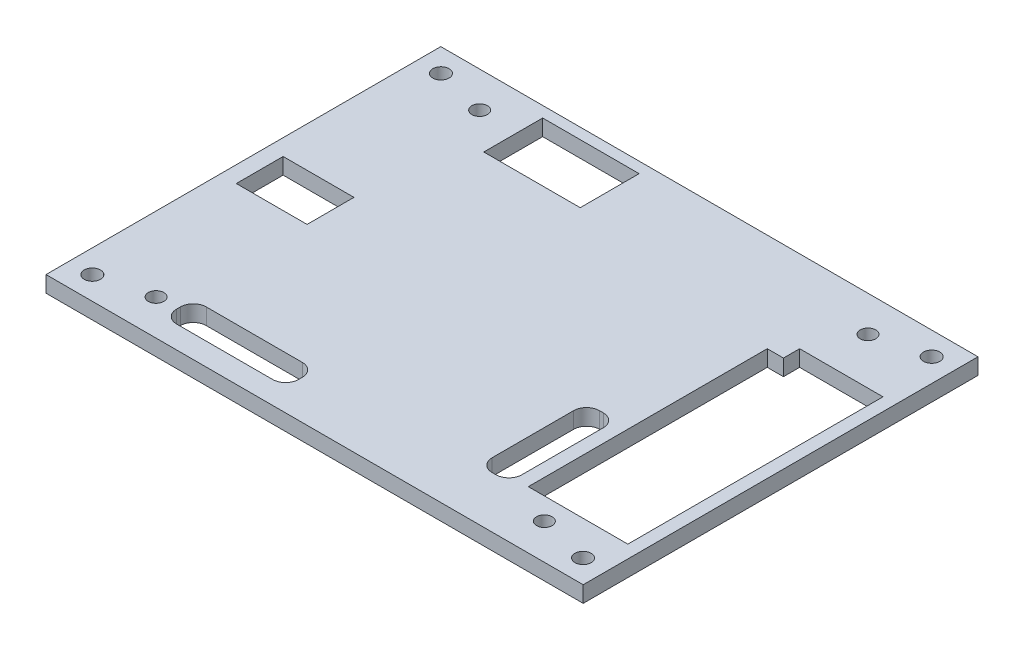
from build123d import *

# Parameters (mm, degrees)
SKETCH1_W          = 105.41
SKETCH1_H          = 77.47
EXTRUDE1_DEPTH     = 3.175
CUT_EXTRUDE1_REACH = 132.855
SKETCH2_R          = 1.524
CUT_EXTRUDE4_REACH = 132.855
SKETCH5_W          = 13.8938
SKETCH5_H          = 9.1948
SKETCH5_W_2        = 23.9268
SKETCH5_H_2        = 5.8166
SKETCH5_W_3        = 5.8166
SKETCH5_H_3        = 21.0566
CUT_EXTRUDE5_REACH = 132.855
SKETCH6_R          = 1.6
FILLET1_R          = 2.54


with BuildPart() as part:
    # Sketch1 → Extrude1 (new body)
    with BuildSketch(Plane(origin=(0, 0, 0), x_dir=(1, 0, 0), z_dir=(0, 1, 0))):
        with Locations((52.705, 38.735)):
            Rectangle(SKETCH1_W, SKETCH1_H)
    extrude(amount=EXTRUDE1_DEPTH)

    # Sketch2 → Cut-Extrude1 (cut, up to next)
    with BuildSketch(Plane(origin=(0, 3.175, 0), x_dir=(1, 0, 0), z_dir=(0, 1, 0)), mode=Mode.PRIVATE) as cut_extrude1_sk1:
        with Locations(Location((14.605, 70.485, 0), (0, 0, 270))):
            Circle(SKETCH2_R)
    cut_extrude1_tool1 = extrude(cut_extrude1_sk1.sketch, amount=-CUT_EXTRUDE1_REACH, mode=Mode.PRIVATE) & part.part
    # Sketch2 → Cut-Extrude1 (cut, up to next)
    with BuildSketch(Plane(origin=(0, 3.175, 0), x_dir=(1, 0, 0), z_dir=(0, 1, 0)), mode=Mode.PRIVATE) as cut_extrude1_sk2:
        with Locations(Location((90.805, 70.485, 0), (0, 0, 270))):
            Circle(SKETCH2_R)
    cut_extrude1_tool2 = extrude(cut_extrude1_sk2.sketch, amount=-CUT_EXTRUDE1_REACH, mode=Mode.PRIVATE) & part.part
    # Sketch2 → Cut-Extrude1 (cut, up to next)
    with BuildSketch(Plane(origin=(0, 3.175, 0), x_dir=(1, 0, 0), z_dir=(0, 1, 0)), mode=Mode.PRIVATE) as cut_extrude1_sk3:
        with Locations(Location((14.605, 6.985, 0), (0, 0, 270))):
            Circle(SKETCH2_R)
    cut_extrude1_tool3 = extrude(cut_extrude1_sk3.sketch, amount=-CUT_EXTRUDE1_REACH, mode=Mode.PRIVATE) & part.part
    # Sketch2 → Cut-Extrude1 (cut, up to next)
    with BuildSketch(Plane(origin=(0, 3.175, 0), x_dir=(1, 0, 0), z_dir=(0, 1, 0)), mode=Mode.PRIVATE) as cut_extrude1_sk4:
        with Locations(Location((90.805, 6.985, 0), (0, 0, 270))):
            Circle(SKETCH2_R)
    cut_extrude1_tool4 = extrude(cut_extrude1_sk4.sketch, amount=-CUT_EXTRUDE1_REACH, mode=Mode.PRIVATE) & part.part
    add(cut_extrude1_tool1.solids().sort_by_distance((14.605, 3.175, -70.485))[0], mode=Mode.SUBTRACT)
    add(cut_extrude1_tool2.solids().sort_by_distance((90.805, 3.175, -70.485))[0], mode=Mode.SUBTRACT)
    add(cut_extrude1_tool3.solids().sort_by_distance((14.605, 3.175, -6.985))[0], mode=Mode.SUBTRACT)
    add(cut_extrude1_tool4.solids().sort_by_distance((90.805, 3.175, -6.985))[0], mode=Mode.SUBTRACT)

    # Sketch5 → Cut-Extrude4 (cut, up to next)
    with BuildSketch(Plane(origin=(0, 3.175, 0), x_dir=(1, 0, 0), z_dir=(0, 1, 0)), mode=Mode.PRIVATE) as cut_extrude4_sk1:
        Polygon((33.5026, 75.3364), (41.0464, 75.3364), (41.0464, 63.7794), (22.1234, 63.7794), (22.1234, 75.3364), (29.6672, 75.3364), align=None)
    cut_extrude4_tool1 = extrude(cut_extrude4_sk1.sketch, amount=-CUT_EXTRUDE4_REACH, mode=Mode.PRIVATE) & part.part
    # Sketch5 → Cut-Extrude4 (cut, up to next)
    with BuildSketch(Plane(origin=(0, 3.175, 0), x_dir=(1, 0, 0), z_dir=(0, 1, 0)), mode=Mode.PRIVATE) as cut_extrude4_sk2:
        with Locations((10.1473, 38.735)):
            Rectangle(SKETCH5_W, SKETCH5_H)
    cut_extrude4_tool2 = extrude(cut_extrude4_sk2.sketch, amount=-CUT_EXTRUDE4_REACH, mode=Mode.PRIVATE) & part.part
    # Sketch5 → Cut-Extrude4 (cut, up to next)
    with BuildSketch(Plane(origin=(0, 3.175, 0), x_dir=(1, 0, 0), z_dir=(0, 1, 0)), mode=Mode.PRIVATE) as cut_extrude4_sk3:
        Polygon((83.3628, 11.2776), (102.8954, 11.2776), (102.8954, 61.341), (86.5378, 61.341), (86.5378, 58.166), (83.3628, 58.166), align=None)
    cut_extrude4_tool3 = extrude(cut_extrude4_sk3.sketch, amount=-CUT_EXTRUDE4_REACH, mode=Mode.PRIVATE) & part.part
    # Sketch5 → Cut-Extrude4 (cut, up to next)
    with BuildSketch(Plane(origin=(0, 3.175, 0), x_dir=(1, 0, 0), z_dir=(0, 1, 0)), mode=Mode.PRIVATE) as cut_extrude4_sk4:
        with Locations((30.6451, 7.3152)):
            Rectangle(SKETCH5_W_2, SKETCH5_H_2)
    cut_extrude4_tool4 = extrude(cut_extrude4_sk4.sketch, amount=-CUT_EXTRUDE4_REACH, mode=Mode.PRIVATE) & part.part
    # Sketch5 → Cut-Extrude4 (cut, up to next)
    with BuildSketch(Plane(origin=(0, 3.175, 0), x_dir=(1, 0, 0), z_dir=(0, 1, 0)), mode=Mode.PRIVATE) as cut_extrude4_sk5:
        with Locations((77.8002, 20.6502)):
            Rectangle(SKETCH5_W_3, SKETCH5_H_3)
    cut_extrude4_tool5 = extrude(cut_extrude4_sk5.sketch, amount=-CUT_EXTRUDE4_REACH, mode=Mode.PRIVATE) & part.part
    add(cut_extrude4_tool1.solids().sort_by_distance((31.5849, 3.175, -69.5579))[0], mode=Mode.SUBTRACT)
    add(cut_extrude4_tool2.solids().sort_by_distance((10.1473, 3.175, -38.735))[0], mode=Mode.SUBTRACT)
    add(cut_extrude4_tool3.solids().sort_by_distance((93.214292, 3.175, -36.065102))[0], mode=Mode.SUBTRACT)
    add(cut_extrude4_tool4.solids().sort_by_distance((30.6451, 3.175, -7.3152))[0], mode=Mode.SUBTRACT)
    add(cut_extrude4_tool5.solids().sort_by_distance((77.8002, 3.175, -20.6502))[0], mode=Mode.SUBTRACT)

    # Sketch6 → Cut-Extrude5 (cut, up to next)
    with BuildSketch(Plane(origin=(0, 3.175, 0), x_dir=(1, 0, 0), z_dir=(0, 1, 0)), mode=Mode.PRIVATE) as cut_extrude5_sk1:
        with Locations(Location((4.5593, 72.9361, 0), (0, 0, 270))):
            Circle(SKETCH6_R)
    cut_extrude5_tool1 = extrude(cut_extrude5_sk1.sketch, amount=-CUT_EXTRUDE5_REACH, mode=Mode.PRIVATE) & part.part
    # Sketch6 → Cut-Extrude5 (cut, up to next)
    with BuildSketch(Plane(origin=(0, 3.175, 0), x_dir=(1, 0, 0), z_dir=(0, 1, 0)), mode=Mode.PRIVATE) as cut_extrude5_sk2:
        with Locations(Location((100.8507, 72.9361, 0), (0, 0, 90))):
            Circle(SKETCH6_R)
    cut_extrude5_tool2 = extrude(cut_extrude5_sk2.sketch, amount=-CUT_EXTRUDE5_REACH, mode=Mode.PRIVATE) & part.part
    # Sketch6 → Cut-Extrude5 (cut, up to next)
    with BuildSketch(Plane(origin=(0, 3.175, 0), x_dir=(1, 0, 0), z_dir=(0, 1, 0)), mode=Mode.PRIVATE) as cut_extrude5_sk3:
        with Locations(Location((100.8507, 4.5339, 0), (0, 0, 270))):
            Circle(SKETCH6_R)
    cut_extrude5_tool3 = extrude(cut_extrude5_sk3.sketch, amount=-CUT_EXTRUDE5_REACH, mode=Mode.PRIVATE) & part.part
    # Sketch6 → Cut-Extrude5 (cut, up to next)
    with BuildSketch(Plane(origin=(0, 3.175, 0), x_dir=(1, 0, 0), z_dir=(0, 1, 0)), mode=Mode.PRIVATE) as cut_extrude5_sk4:
        with Locations(Location((4.5593, 4.5339, 0), (0, 0, 90))):
            Circle(SKETCH6_R)
    cut_extrude5_tool4 = extrude(cut_extrude5_sk4.sketch, amount=-CUT_EXTRUDE5_REACH, mode=Mode.PRIVATE) & part.part
    add(cut_extrude5_tool1.solids().sort_by_distance((4.5593, 3.175, -72.9361))[0], mode=Mode.SUBTRACT)
    add(cut_extrude5_tool2.solids().sort_by_distance((100.8507, 3.175, -72.9361))[0], mode=Mode.SUBTRACT)
    add(cut_extrude5_tool3.solids().sort_by_distance((100.8507, 3.175, -4.5339))[0], mode=Mode.SUBTRACT)
    add(cut_extrude5_tool4.solids().sort_by_distance((4.5593, 3.175, -4.5339))[0], mode=Mode.SUBTRACT)

    # Fillet1
    fillet1_edges = [part.edges().sort_by_distance(p)[0] for p in [
        (18.6817, 1.5875, -4.4069),
        (18.6817, 1.5875, -10.2235),
        (42.6085, 1.5875, -10.2235),
        (42.6085, 1.5875, -4.4069),
        (74.8919, 1.5875, -10.1219),
        (74.8919, 1.5875, -31.1785),
        (80.7085, 1.5875, -31.1785),
        (80.7085, 1.5875, -10.1219),
    ]]
    fillet(fillet1_edges, radius=FILLET1_R)


solid = part.part
